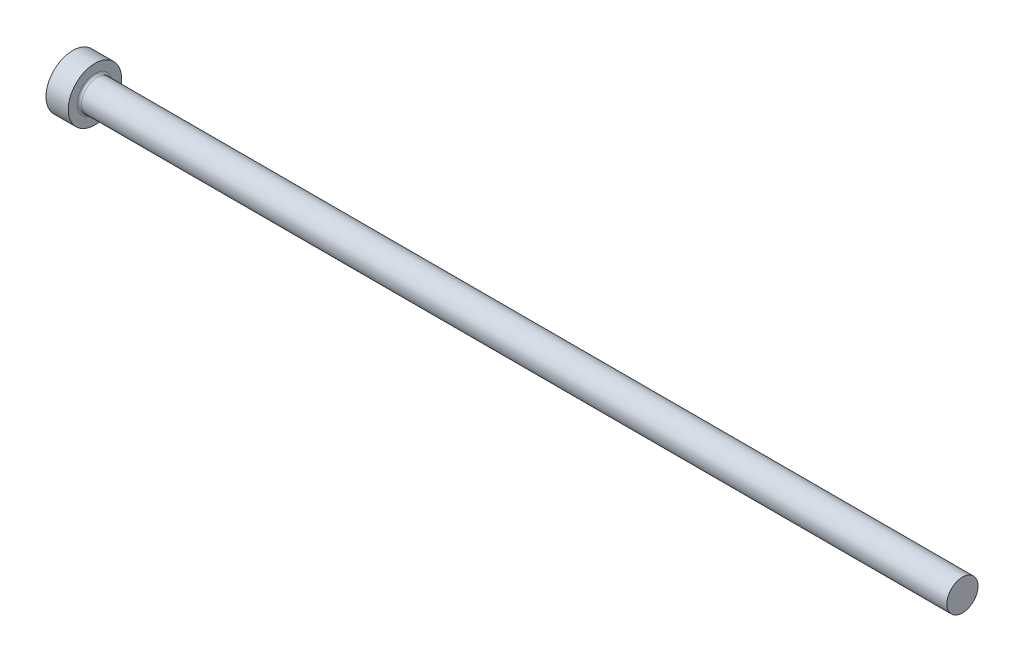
ISO-10303-21;
HEADER;
FILE_DESCRIPTION(('STEP AP214'),'2;1');
FILE_NAME('part.step','',(''),(''),'','','');
FILE_SCHEMA(('AUTOMOTIVE_DESIGN { 1 0 10303 214 1 1 1 1 }'));
ENDSEC;
DATA;
#1=APPLICATION_CONTEXT('core data for automotive mechanical design processes');
#2=APPLICATION_PROTOCOL_DEFINITION('international standard','automotive_design',2000,#1);
#3=PRODUCT_CONTEXT('',#1,'mechanical');
#4=PRODUCT('Part','Part','',(#3));
#5=PRODUCT_RELATED_PRODUCT_CATEGORY('part','',(#4));
#6=PRODUCT_DEFINITION_FORMATION('','',#4);
#7=PRODUCT_DEFINITION_CONTEXT('part definition',#1,'design');
#8=PRODUCT_DEFINITION('design','',#6,#7);
#9=PRODUCT_DEFINITION_SHAPE('','',#8);
#10=(LENGTH_UNIT() NAMED_UNIT(*) SI_UNIT(.MILLI.,.METRE.));
#11=(NAMED_UNIT(*) PLANE_ANGLE_UNIT() SI_UNIT($,.RADIAN.));
#12=(NAMED_UNIT(*) SI_UNIT($,.STERADIAN.) SOLID_ANGLE_UNIT());
#13=UNCERTAINTY_MEASURE_WITH_UNIT(LENGTH_MEASURE(1.E-05),#10,'distance_accuracy_value','');
#14=(GEOMETRIC_REPRESENTATION_CONTEXT(3) GLOBAL_UNCERTAINTY_ASSIGNED_CONTEXT((#13)) GLOBAL_UNIT_ASSIGNED_CONTEXT((#10,
#11,#12)) REPRESENTATION_CONTEXT('',''));
#15=CARTESIAN_POINT('',(0.,0.,0.));
#16=DIRECTION('',(0.,0.,1.));
#17=DIRECTION('',(1.,0.,0.));
#18=AXIS2_PLACEMENT_3D('',#15,#16,#17);
#19=CARTESIAN_POINT('',(0.,0.,0.));
#20=DIRECTION('',(-1.,0.,0.));
#21=DIRECTION('',(0.,-1.,0.));
#22=AXIS2_PLACEMENT_3D('',#19,#20,#21);
#23=PLANE('',#22);
#24=CARTESIAN_POINT('',(0.,0.,0.));
#25=DIRECTION('',(1.,0.,0.));
#26=DIRECTION('',(0.,1.,0.));
#27=AXIS2_PLACEMENT_3D('',#24,#25,#26);
#28=CIRCLE('',#27,6.);
#29=CARTESIAN_POINT('',(0.,6.,0.));
#30=VERTEX_POINT('',#29);
#31=EDGE_CURVE('E24',#30,#30,#28,.T.);
#32=ORIENTED_EDGE('',*,*,#31,.F.);
#33=EDGE_LOOP('',(#32));
#34=FACE_BOUND('',#33,.T.);
#35=ADVANCED_FACE('F13',(#34),#23,.T.);
#36=CARTESIAN_POINT('',(200.,0.,0.));
#37=DIRECTION('',(1.,0.,0.));
#38=DIRECTION('',(0.,1.,0.));
#39=AXIS2_PLACEMENT_3D('',#36,#37,#38);
#40=CYLINDRICAL_SURFACE('',#39,6.);
#41=ORIENTED_EDGE('',*,*,#31,.T.);
#42=EDGE_LOOP('',(#41));
#43=FACE_BOUND('',#42,.T.);
#44=CARTESIAN_POINT('',(5.,0.,0.));
#45=DIRECTION('',(1.,0.,0.));
#46=DIRECTION('',(0.,1.,0.));
#47=AXIS2_PLACEMENT_3D('',#44,#45,#46);
#48=CIRCLE('',#47,6.);
#49=CARTESIAN_POINT('',(5.,6.,0.));
#50=VERTEX_POINT('',#49);
#51=EDGE_CURVE('E28',#50,#50,#48,.T.);
#52=ORIENTED_EDGE('',*,*,#51,.F.);
#53=EDGE_LOOP('',(#52));
#54=FACE_BOUND('',#53,.T.);
#55=ADVANCED_FACE('F50',(#43,#54),#40,.T.);
#56=CARTESIAN_POINT('',(5.,6.,0.));
#57=DIRECTION('',(1.,0.,0.));
#58=DIRECTION('',(0.,1.,0.));
#59=AXIS2_PLACEMENT_3D('',#56,#57,#58);
#60=PLANE('',#59);
#61=CARTESIAN_POINT('',(5.,0.,0.));
#62=DIRECTION('',(1.,0.,0.));
#63=DIRECTION('',(0.,1.,0.));
#64=AXIS2_PLACEMENT_3D('',#61,#62,#63);
#65=CIRCLE('',#64,4.);
#66=CARTESIAN_POINT('',(5.,4.,0.));
#67=VERTEX_POINT('',#66);
#68=EDGE_CURVE('E8',#67,#67,#65,.F.);
#69=ORIENTED_EDGE('',*,*,#68,.T.);
#70=EDGE_LOOP('',(#69));
#71=FACE_BOUND('',#70,.T.);
#72=ORIENTED_EDGE('',*,*,#51,.T.);
#73=EDGE_LOOP('',(#72));
#74=FACE_BOUND('',#73,.T.);
#75=ADVANCED_FACE('F41',(#71,#74),#60,.T.);
#76=CARTESIAN_POINT('',(200.,0.,0.));
#77=DIRECTION('',(1.,0.,0.));
#78=DIRECTION('',(0.,1.,0.));
#79=AXIS2_PLACEMENT_3D('',#76,#77,#78);
#80=CYLINDRICAL_SURFACE('',#79,3.5);
#81=CARTESIAN_POINT('',(5.5,0.,0.));
#82=DIRECTION('',(1.,0.,0.));
#83=DIRECTION('',(0.,1.,0.));
#84=AXIS2_PLACEMENT_3D('',#81,#82,#83);
#85=CIRCLE('',#84,3.5);
#86=CARTESIAN_POINT('',(5.5,3.5,0.));
#87=VERTEX_POINT('',#86);
#88=EDGE_CURVE('E20',#87,#87,#85,.T.);
#89=ORIENTED_EDGE('',*,*,#88,.T.);
#90=EDGE_LOOP('',(#89));
#91=FACE_BOUND('',#90,.T.);
#92=CARTESIAN_POINT('',(200.,0.,0.));
#93=DIRECTION('',(1.,0.,0.));
#94=DIRECTION('',(0.,1.,0.));
#95=AXIS2_PLACEMENT_3D('',#92,#93,#94);
#96=CIRCLE('',#95,3.5);
#97=CARTESIAN_POINT('',(200.,3.5,0.));
#98=VERTEX_POINT('',#97);
#99=EDGE_CURVE('E33',#98,#98,#96,.T.);
#100=ORIENTED_EDGE('',*,*,#99,.F.);
#101=EDGE_LOOP('',(#100));
#102=FACE_BOUND('',#101,.T.);
#103=ADVANCED_FACE('F39',(#91,#102),#80,.T.);
#104=CARTESIAN_POINT('',(200.,3.5,0.));
#105=DIRECTION('',(1.,0.,0.));
#106=DIRECTION('',(0.,1.,0.));
#107=AXIS2_PLACEMENT_3D('',#104,#105,#106);
#108=PLANE('',#107);
#109=ORIENTED_EDGE('',*,*,#99,.T.);
#110=EDGE_LOOP('',(#109));
#111=FACE_BOUND('',#110,.T.);
#112=ADVANCED_FACE('F37',(#111),#108,.T.);
#113=CARTESIAN_POINT('',(5.5,0.,0.));
#114=DIRECTION('',(1.,0.,0.));
#115=DIRECTION('',(0.,1.,0.));
#116=AXIS2_PLACEMENT_3D('',#113,#114,#115);
#117=TOROIDAL_SURFACE('',#116,4.,0.5);
#118=ORIENTED_EDGE('',*,*,#68,.F.);
#119=EDGE_LOOP('',(#118));
#120=FACE_BOUND('',#119,.T.);
#121=ORIENTED_EDGE('',*,*,#88,.F.);
#122=EDGE_LOOP('',(#121));
#123=FACE_BOUND('',#122,.T.);
#124=ADVANCED_FACE('F15',(#120,#123),#117,.F.);
#125=CLOSED_SHELL('',(#35,#55,#75,#103,#112,#124));
#126=MANIFOLD_SOLID_BREP('B1',#125);
#127=ADVANCED_BREP_SHAPE_REPRESENTATION('',(#18,#126),#14);
#128=SHAPE_DEFINITION_REPRESENTATION(#9,#127);
ENDSEC;
END-ISO-10303-21;
